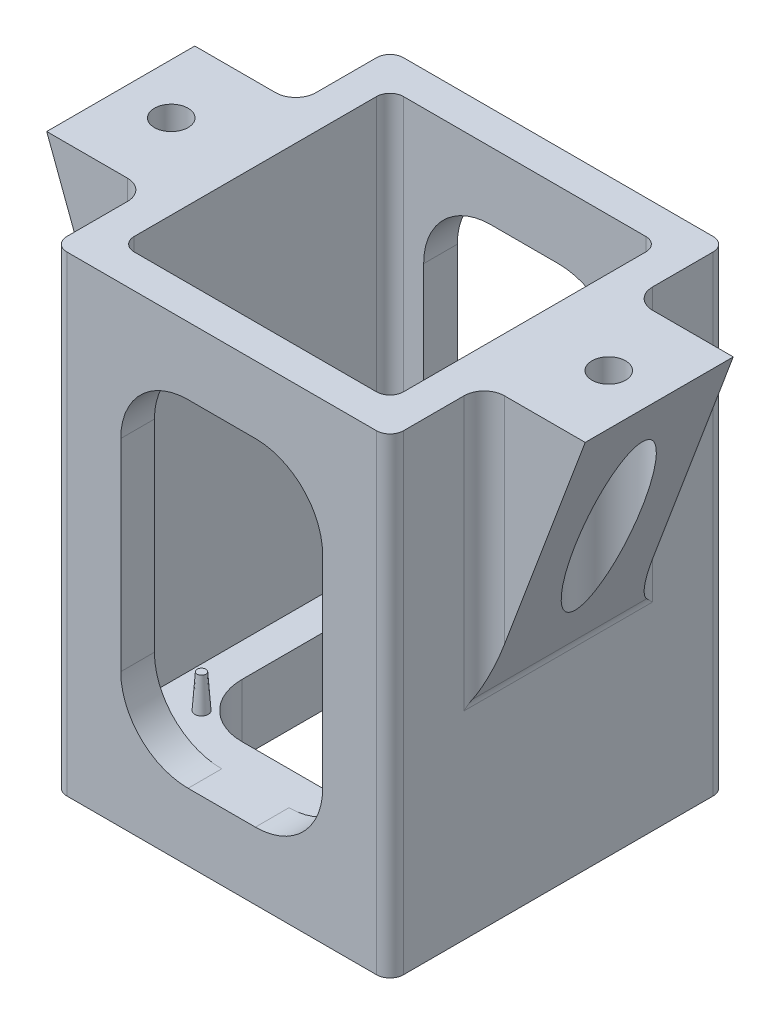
from build123d import *

# Parameters (mm, degrees)
ESBO_O1_W                          = 50
ESBO_O1_H                          = 50
RESSALTO_EXTRUS_O1_DEPTH           = 70
ESBO_O2_W                          = 40
ESBO_O2_H                          = 40
CORTE_EXTRUS_O2_DEPTH              = 60
CORTE_EXTRUS_O4_DEPTH              = 10
ESBO_O4_R                          = 1
RESSALTO_EXTRUS_O2_DEPTH           = 5
RESSALTO_EXTRUS_O2_DRAFT           = 4
RESSALTO_EXTRUS_O2_PROFILE_2_DEPTH = 5
RESSALTO_EXTRUS_O2_PROFILE_2_DRAFT = 4
RESSALTO_EXTRUS_O2_PROFILE_3_DEPTH = 5
RESSALTO_EXTRUS_O2_PROFILE_3_DRAFT = 4
RESSALTO_EXTRUS_O2_PROFILE_4_DEPTH = 5
RESSALTO_EXTRUS_O2_PROFILE_4_DRAFT = 4
RESSALTO_EXTRUS_O3_DEPTH           = 11
ESBO_O6_R                          = 2.5
CORTE_EXTRUS_O5_DEPTH              = 85.409715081
CORTE_EXTRUS_O8_START              = -4
ESBO_O7_R                          = 5
CORTE_EXTRUS_O8_DEPTH              = 81.409715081
FILETE1_R                          = 3
CORTE_EXTRUS_O9_REACH              = 96.868
FILETE2_R                          = 2


with BuildPart() as part:
    # Esbo_o1 → Ressalto-extrus_o1 (new body)
    with BuildSketch(Plane(origin=(0, 0, 0), x_dir=(1, 0, 0), z_dir=(0, 1, 0))):
        Rectangle(ESBO_O1_W, ESBO_O1_H)
    extrude(amount=RESSALTO_EXTRUS_O1_DEPTH)

    # Esbo_o2 → Corte-extrus_o2 (cut)
    with BuildSketch(Plane(origin=(0, 70, 0), x_dir=(1, 0, 0), z_dir=(0, 1, 0))):
        Rectangle(ESBO_O2_W, ESBO_O2_H)
    extrude(amount=-CORTE_EXTRUS_O2_DEPTH, mode=Mode.SUBTRACT)

    # Esbo_o3 → Corte-extrus_o4 (cut)
    with BuildSketch(Plane(origin=(0, 10, 0), x_dir=(1, 0, 0), z_dir=(0, 1, 0))):
        with BuildLine():
            Line((7, 15), (-7, 15))
            ThreePointArc((-7, 15), (-12.656854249, 12.656854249), (-15, 7))
            Line((-15, 7), (-15, -7))
            ThreePointArc((-15, -7), (-12.656854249, -12.656854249), (-7, -15))
            Line((-7, -15), (7, -15))
            ThreePointArc((7, -15), (12.656854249, -12.656854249), (15, -7))
            Line((15, -7), (15, 7))
            ThreePointArc((15, 7), (12.656854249, 12.656854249), (7, 15))
        make_face()
    extrude(amount=-CORTE_EXTRUS_O4_DEPTH, mode=Mode.SUBTRACT)


with BuildPart() as ressalto_extrus_o2_tool:
    # Esbo_o4 → Ressalto-extrus_o2 (with draft: the straight prism first)
    with BuildSketch(Plane(origin=(0, 10, 0), x_dir=(1, 0, 0), z_dir=(0, 1, 0))):
        with Locations((-14, 14)):
            Circle(ESBO_O4_R)
    extrude(amount=RESSALTO_EXTRUS_O2_DEPTH)
    # Ressalto-extrus_o2: the draft: its side faces are tilted about the plane it starts from
    ressalto_extrus_o2_sides = [ressalto_extrus_o2_tool.faces().sort_by_distance(p)[0] for p in [
        (-15, 12.5, -14),
    ]]
    draft(ressalto_extrus_o2_sides, Plane(origin=(0, 10, 0), x_dir=(1, 0, 0), z_dir=(0, 1, 0)), RESSALTO_EXTRUS_O2_DRAFT)


with BuildPart() as part_1:
    add(part.part)

    # Ressalto-extrus_o2: add ressalto_extrus_o2_tool
    add(ressalto_extrus_o2_tool.part)


with BuildPart() as ressalto_extrus_o2_profile_2_tool:
    # Esbo_o4 → Ressalto-extrus_o2 profile 2 (with draft: the straight prism first)
    with BuildSketch(Plane(origin=(0, 10, 0), x_dir=(1, 0, 0), z_dir=(0, 1, 0))):
        with Locations((14, 14)):
            Circle(ESBO_O4_R)
    extrude(amount=RESSALTO_EXTRUS_O2_PROFILE_2_DEPTH)
    # Ressalto-extrus_o2 profile 2: the draft: its side faces are tilted about the plane it starts from
    ressalto_extrus_o2_profile_2_sides = [ressalto_extrus_o2_profile_2_tool.faces().sort_by_distance(p)[0] for p in [
        (13, 12.5, -14),
    ]]
    draft(ressalto_extrus_o2_profile_2_sides, Plane(origin=(0, 10, 0), x_dir=(1, 0, 0), z_dir=(0, 1, 0)), RESSALTO_EXTRUS_O2_PROFILE_2_DRAFT)


with BuildPart() as part_2:
    add(part_1.part)

    # Ressalto-extrus_o2 profile 2: add ressalto_extrus_o2_profile_2_tool
    add(ressalto_extrus_o2_profile_2_tool.part)


with BuildPart() as ressalto_extrus_o2_profile_3_tool:
    # Esbo_o4 → Ressalto-extrus_o2 profile 3 (with draft: the straight prism first)
    with BuildSketch(Plane(origin=(0, 10, 0), x_dir=(1, 0, 0), z_dir=(0, 1, 0))):
        with Locations((14, -14)):
            Circle(ESBO_O4_R)
    extrude(amount=RESSALTO_EXTRUS_O2_PROFILE_3_DEPTH)
    # Ressalto-extrus_o2 profile 3: the draft: its side faces are tilted about the plane it starts from
    ressalto_extrus_o2_profile_3_sides = [ressalto_extrus_o2_profile_3_tool.faces().sort_by_distance(p)[0] for p in [
        (13, 12.5, 14),
    ]]
    draft(ressalto_extrus_o2_profile_3_sides, Plane(origin=(0, 10, 0), x_dir=(1, 0, 0), z_dir=(0, 1, 0)), RESSALTO_EXTRUS_O2_PROFILE_3_DRAFT)


with BuildPart() as part_3:
    add(part_2.part)

    # Ressalto-extrus_o2 profile 3: add ressalto_extrus_o2_profile_3_tool
    add(ressalto_extrus_o2_profile_3_tool.part)


with BuildPart() as ressalto_extrus_o2_profile_4_tool:
    # Esbo_o4 → Ressalto-extrus_o2 profile 4 (with draft: the straight prism first)
    with BuildSketch(Plane(origin=(0, 10, 0), x_dir=(1, 0, 0), z_dir=(0, 1, 0))):
        with Locations((-14, -14)):
            Circle(ESBO_O4_R)
    extrude(amount=RESSALTO_EXTRUS_O2_PROFILE_4_DEPTH)
    # Ressalto-extrus_o2 profile 4: the draft: its side faces are tilted about the plane it starts from
    ressalto_extrus_o2_profile_4_sides = [ressalto_extrus_o2_profile_4_tool.faces().sort_by_distance(p)[0] for p in [
        (-15, 12.5, 14),
    ]]
    draft(ressalto_extrus_o2_profile_4_sides, Plane(origin=(0, 10, 0), x_dir=(1, 0, 0), z_dir=(0, 1, 0)), RESSALTO_EXTRUS_O2_PROFILE_4_DRAFT)


with BuildPart() as part_4:
    add(part_3.part)

    # Ressalto-extrus_o2 profile 4: add ressalto_extrus_o2_profile_4_tool
    add(ressalto_extrus_o2_profile_4_tool.part)

    # Esbo_o5 → Ressalto-extrus_o3 (add, symmetric)
    with BuildSketch(Plane.XY):
        Polygon((25, 70), (25, 30), (40, 70), align=None)
    ressalto_extrus_o3 = extrude(amount=RESSALTO_EXTRUS_O3_DEPTH, both=True)

    # Esbo_o6 → Corte-extrus_o5 (cut, through all)
    with BuildSketch(Plane(origin=(0, 70, 0), x_dir=(1, 0, 0), z_dir=(0, 1, 0))):
        with Locations(Location((32.5, 0, 0), (0, 0, 270))):
            Circle(ESBO_O6_R)
    corte_extrus_o5 = extrude(amount=-CORTE_EXTRUS_O5_DEPTH, mode=Mode.SUBTRACT)

    # Esbo_o7 → Corte-extrus_o8 (cut, through all)
    with BuildSketch(Plane(origin=(0, 70, 0), x_dir=(1, 0, 0), z_dir=(0, 1, 0)).offset(CORTE_EXTRUS_O8_START)):
        with Locations(Location((32.5, 0, 0), (0, 0, 270))):
            Circle(ESBO_O7_R)
    corte_extrus_o8 = extrude(amount=-CORTE_EXTRUS_O8_DEPTH, mode=Mode.SUBTRACT)

    # Espelhar5: Ressalto-extrus_o3, Corte-extrus_o5, Corte-extrus_o8 across plane
    add(ressalto_extrus_o3.mirror(Plane(origin=(0, 0, 0), x_dir=(0, 0, 1), z_dir=(1, 0, 0))))
    add(corte_extrus_o5.mirror(Plane(origin=(0, 0, 0), x_dir=(0, 0, 1), z_dir=(1, 0, 0))), mode=Mode.SUBTRACT)
    add(corte_extrus_o8.mirror(Plane(origin=(0, 0, 0), x_dir=(0, 0, 1), z_dir=(1, 0, 0))), mode=Mode.SUBTRACT)

    # Filete1
    filete1_edges = [part_4.edges().sort_by_distance(p)[0] for p in [
        (25, 50, -11),
        (25, 30, 0),
        (25, 50, 11),
        (-25, 50, 11),
        (-25, 50, -11),
    ]]
    fillet(filete1_edges, radius=FILETE1_R)

    # Esbo_o8 → Corte-extrus_o9 (cut, up to next)
    with BuildSketch(Plane(origin=(0, 0, -25), x_dir=(-1, 0, 0), z_dir=(0, 0, -1)), mode=Mode.PRIVATE) as corte_extrus_o9_sk1:
        with BuildLine():
            Line((-5, 10), (5, 10))
            ThreePointArc((5, 10), (12.071067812, 12.928932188), (15, 20))
            Line((15, 20), (15, 50))
            ThreePointArc((15, 50), (12.071067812, 57.071067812), (5, 60))
            Line((5, 60), (-5, 60))
            ThreePointArc((-5, 60), (-12.071067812, 57.071067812), (-15, 50))
            Line((-15, 50), (-15, 20))
            ThreePointArc((-15, 20), (-12.071067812, 12.928932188), (-5, 10))
        make_face()
    corte_extrus_o9_tool1 = extrude(corte_extrus_o9_sk1.sketch, amount=-CORTE_EXTRUS_O9_REACH, mode=Mode.PRIVATE) & part_4.part
    corte_extrus_o9 = corte_extrus_o9_tool1.solids().sort_by_distance((0, 35, -25))[0]
    add(corte_extrus_o9, mode=Mode.SUBTRACT)

    # Espelhar8: Corte-extrus_o9 across plane
    add(corte_extrus_o9.mirror(Plane.XY), mode=Mode.SUBTRACT)

    # Filete2
    filete2_edges = [part_4.edges().sort_by_distance(p)[0] for p in [
        (20, 40, 20),
        (20, 40, -20),
        (-20, 40, -20),
        (-20, 40, 20),
        (25, 35, 25),
        (-25, 35, 25),
        (-25, 35, -25),
        (25, 35, -25),
    ]]
    fillet(filete2_edges, radius=FILETE2_R)


solid = part_4.part
